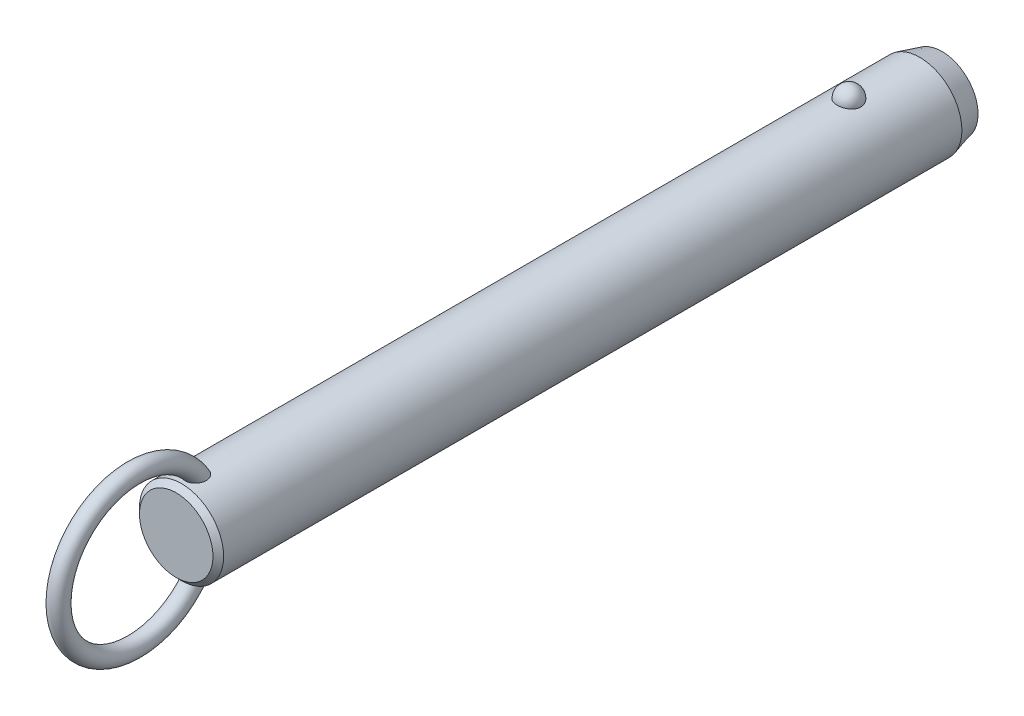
ISO-10303-21;
HEADER;
FILE_DESCRIPTION(('STEP AP214'),'2;1');
FILE_NAME('part.step','',(''),(''),'','','');
FILE_SCHEMA(('AUTOMOTIVE_DESIGN { 1 0 10303 214 1 1 1 1 }'));
ENDSEC;
DATA;
#1=APPLICATION_CONTEXT('core data for automotive mechanical design processes');
#2=APPLICATION_PROTOCOL_DEFINITION('international standard','automotive_design',2000,#1);
#3=PRODUCT_CONTEXT('',#1,'mechanical');
#4=PRODUCT('Part','Part','',(#3));
#5=PRODUCT_RELATED_PRODUCT_CATEGORY('part','',(#4));
#6=PRODUCT_DEFINITION_FORMATION('','',#4);
#7=PRODUCT_DEFINITION_CONTEXT('part definition',#1,'design');
#8=PRODUCT_DEFINITION('design','',#6,#7);
#9=PRODUCT_DEFINITION_SHAPE('','',#8);
#10=(LENGTH_UNIT() NAMED_UNIT(*) SI_UNIT(.MILLI.,.METRE.));
#11=(NAMED_UNIT(*) PLANE_ANGLE_UNIT() SI_UNIT($,.RADIAN.));
#12=(NAMED_UNIT(*) SI_UNIT($,.STERADIAN.) SOLID_ANGLE_UNIT());
#13=UNCERTAINTY_MEASURE_WITH_UNIT(LENGTH_MEASURE(1.E-05),#10,'distance_accuracy_value','');
#14=(GEOMETRIC_REPRESENTATION_CONTEXT(3) GLOBAL_UNCERTAINTY_ASSIGNED_CONTEXT((#13)) GLOBAL_UNIT_ASSIGNED_CONTEXT((#10,
#11,#12)) REPRESENTATION_CONTEXT('',''));
#15=CARTESIAN_POINT('',(0.,0.,0.));
#16=DIRECTION('',(0.,0.,1.));
#17=DIRECTION('',(1.,0.,0.));
#18=AXIS2_PLACEMENT_3D('',#15,#16,#17);
#19=CARTESIAN_POINT('',(0.,0.,139.7));
#20=DIRECTION('',(0.,0.,-1.));
#21=DIRECTION('',(-1.,0.,0.));
#22=AXIS2_PLACEMENT_3D('',#19,#20,#21);
#23=CYLINDRICAL_SURFACE('',#22,9.5);
#24=CARTESIAN_POINT('',(2.67259918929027,9.11631578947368,-2.70000000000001));
#25=CARTESIAN_POINT('',(2.6725968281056,9.11631786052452,-2.54909854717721));
#26=CARTESIAN_POINT('',(2.66030567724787,9.11994722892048,-2.39816735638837));
#27=CARTESIAN_POINT('',(2.6114347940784,9.13405924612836,-2.10058568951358));
#28=CARTESIAN_POINT('',(2.57484658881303,9.14454428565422,-1.95393672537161));
#29=CARTESIAN_POINT('',(2.47830875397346,9.17117631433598,-1.66916069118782));
#30=CARTESIAN_POINT('',(2.41836936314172,9.18732082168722,-1.53102991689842));
#31=CARTESIAN_POINT('',(2.27661331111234,9.22346780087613,-1.26705393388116));
#32=CARTESIAN_POINT('',(2.19479699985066,9.24347021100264,-1.14120852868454));
#33=CARTESIAN_POINT('',(2.01085282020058,9.28522401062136,-0.904632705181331));
#34=CARTESIAN_POINT('',(1.90862396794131,9.30698376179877,-0.793982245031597));
#35=CARTESIAN_POINT('',(1.6867437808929,9.34973971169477,-0.591607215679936));
#36=CARTESIAN_POINT('',(1.56709244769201,9.37073591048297,-0.499882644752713));
#37=CARTESIAN_POINT('',(1.31393976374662,9.40956370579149,-0.338167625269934));
#38=CARTESIAN_POINT('',(1.18048026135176,9.42740444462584,-0.268113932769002));
#39=CARTESIAN_POINT('',(0.903154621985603,9.45799906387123,-0.151390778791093));
#40=CARTESIAN_POINT('',(0.759289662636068,9.47075351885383,-0.104718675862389));
#41=CARTESIAN_POINT('',(0.468074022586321,9.48956256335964,-0.0367633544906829));
#42=CARTESIAN_POINT('',(0.320836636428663,9.49573643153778,-0.0150275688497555));
#43=CARTESIAN_POINT('',(0.0246714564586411,9.50112183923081,0.00396199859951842));
#44=CARTESIAN_POINT('',(-0.124256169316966,9.50033406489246,0.00121819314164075));
#45=CARTESIAN_POINT('',(-0.417264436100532,9.4919475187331,-0.0284441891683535));
#46=CARTESIAN_POINT('',(-0.56138413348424,9.48444885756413,-0.0550074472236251));
#47=CARTESIAN_POINT('',(-0.842986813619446,9.46357853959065,-0.131064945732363));
#48=CARTESIAN_POINT('',(-0.980469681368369,9.450206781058,-0.180559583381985));
#49=CARTESIAN_POINT('',(-1.24585005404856,9.41890822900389,-0.301476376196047));
#50=CARTESIAN_POINT('',(-1.37368611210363,9.40095498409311,-0.373026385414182));
#51=CARTESIAN_POINT('',(-1.61552738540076,9.36242964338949,-0.536025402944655));
#52=CARTESIAN_POINT('',(-1.72953116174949,9.34185727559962,-0.627476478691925));
#53=CARTESIAN_POINT('',(-1.9429225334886,9.29984568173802,-0.829844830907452));
#54=CARTESIAN_POINT('',(-2.04198021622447,9.27839736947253,-0.94110821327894));
#55=CARTESIAN_POINT('',(-2.22026460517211,9.23735994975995,-1.17883414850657));
#56=CARTESIAN_POINT('',(-2.29948985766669,9.21777097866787,-1.30529781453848));
#57=CARTESIAN_POINT('',(-2.43697287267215,9.18238994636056,-1.57158566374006));
#58=CARTESIAN_POINT('',(-2.49497068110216,9.16664569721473,-1.71155057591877));
#59=CARTESIAN_POINT('',(-2.5872073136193,9.14104303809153,-1.99961197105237));
#60=CARTESIAN_POINT('',(-2.62144683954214,9.13118445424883,-2.14770821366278));
#61=CARTESIAN_POINT('',(-2.66521466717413,9.11850622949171,-2.44715424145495));
#62=CARTESIAN_POINT('',(-2.67484831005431,9.11565658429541,-2.59848735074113));
#63=CARTESIAN_POINT('',(-2.66946735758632,9.11723375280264,-2.90067317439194));
#64=CARTESIAN_POINT('',(-2.65445345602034,9.12166036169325,-3.05152590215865));
#65=CARTESIAN_POINT('',(-2.60029711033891,9.13724422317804,-3.34766110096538));
#66=CARTESIAN_POINT('',(-2.56127978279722,9.14836656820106,-3.49296833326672));
#67=CARTESIAN_POINT('',(-2.46018844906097,9.17606676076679,-3.77477535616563));
#68=CARTESIAN_POINT('',(-2.39811349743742,9.1926448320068,-3.9112747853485));
#69=CARTESIAN_POINT('',(-2.25202303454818,9.22952198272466,-4.17244273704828));
#70=CARTESIAN_POINT('',(-2.16788714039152,9.24984129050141,-4.29704106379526));
#71=CARTESIAN_POINT('',(-1.9799408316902,9.29188255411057,-4.53013066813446));
#72=CARTESIAN_POINT('',(-1.87612963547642,9.31360456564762,-4.63862130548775));
#73=CARTESIAN_POINT('',(-1.65105429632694,9.35612959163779,-4.8369029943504));
#74=CARTESIAN_POINT('',(-1.52972405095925,9.37692871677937,-4.92661991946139));
#75=CARTESIAN_POINT('',(-1.27318250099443,9.41518970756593,-5.08429106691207));
#76=CARTESIAN_POINT('',(-1.13797219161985,9.432651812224,-5.15224684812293));
#77=CARTESIAN_POINT('',(-0.859280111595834,9.46208255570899,-5.26371827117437));
#78=CARTESIAN_POINT('',(-0.715925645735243,9.47411833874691,-5.30753421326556));
#79=CARTESIAN_POINT('',(-0.423550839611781,9.4916822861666,-5.37076321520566));
#80=CARTESIAN_POINT('',(-0.2745312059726,9.49721125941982,-5.39017930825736));
#81=CARTESIAN_POINT('',(0.0218446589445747,9.50110860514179,-5.40390587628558));
#82=CARTESIAN_POINT('',(0.16917707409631,9.49961381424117,-5.39869609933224));
#83=CARTESIAN_POINT('',(0.460808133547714,9.48993906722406,-5.36441955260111));
#84=CARTESIAN_POINT('',(0.605106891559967,9.48175936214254,-5.33535367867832));
#85=CARTESIAN_POINT('',(0.886027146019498,9.4596376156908,-5.25435587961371));
#86=CARTESIAN_POINT('',(1.02267710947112,9.44571881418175,-5.20251612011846));
#87=CARTESIAN_POINT('',(1.28523827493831,9.41358993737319,-5.07741549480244));
#88=CARTESIAN_POINT('',(1.41114877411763,9.39537958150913,-5.00415322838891));
#89=CARTESIAN_POINT('',(1.65085227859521,9.3562644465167,-4.83684599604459));
#90=CARTESIAN_POINT('',(1.76442346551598,9.33532178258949,-4.74249218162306));
#91=CARTESIAN_POINT('',(1.97425672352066,9.29321198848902,-4.53620389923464));
#92=CARTESIAN_POINT('',(2.07051582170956,9.27204482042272,-4.42426641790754));
#93=CARTESIAN_POINT('',(2.24490086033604,9.23139221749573,-4.18363183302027));
#94=CARTESIAN_POINT('',(2.32267019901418,9.21194380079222,-4.05466990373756));
#95=CARTESIAN_POINT('',(2.45584092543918,9.1773419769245,-3.78517836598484));
#96=CARTESIAN_POINT('',(2.5112497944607,9.16218713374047,-3.64465264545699));
#97=CARTESIAN_POINT('',(2.59380876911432,9.13913522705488,-3.37104301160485));
#98=CARTESIAN_POINT('',(2.62330266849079,9.13064624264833,-3.23871053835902));
#99=CARTESIAN_POINT('',(2.66269870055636,9.11923566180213,-2.97092664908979));
#100=CARTESIAN_POINT('',(2.67260130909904,9.11631393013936,-2.83547530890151));
#101=CARTESIAN_POINT('',(2.67259918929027,9.11631578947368,-2.70000000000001));
#102=B_SPLINE_CURVE_WITH_KNOTS('',3,(#24,#25,#26,#27,#28,#29,#30,#31,#32,#33,#34,#35,#36,#37,
#38,#39,#40,#41,#42,#43,#44,#45,#46,#47,#48,#49,#50,#51,#52,#53,#54,#55,#56,#57,#58,#59,#60,#61,
#62,#63,#64,#65,#66,#67,#68,#69,#70,#71,#72,#73,#74,#75,#76,#77,#78,#79,#80,#81,#82,#83,#84,#85,
#86,#87,#88,#89,#90,#91,#92,#93,#94,#95,#96,#97,#98,#99,#100,#101),.UNSPECIFIED.,.T.,.F.,(4,2,2,
2,2,2,2,2,2,2,2,2,2,2,2,2,2,2,2,2,2,2,2,2,2,2,2,2,2,2,2,2,2,2,2,2,2,2,4),(0.,0.452217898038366,
0.904593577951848,1.35677112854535,1.80894144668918,2.26340676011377,2.71787203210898,
3.17099820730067,3.62407318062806,4.0687883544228,4.51345969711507,4.95160616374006,
5.38976021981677,5.83050358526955,6.27129275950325,6.72071308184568,7.17016633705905,
7.62495278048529,8.07972578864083,8.53254856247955,8.98535859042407,9.43582813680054,
9.88631615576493,10.3393155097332,10.7923328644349,11.2471065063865,11.7018475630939,
12.150795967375,12.599688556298,13.0398725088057,13.4800399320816,13.9184421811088,
14.3568730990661,14.802202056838,15.2476074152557,15.7010097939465,16.1542603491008,
16.5602594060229,16.966248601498),.UNSPECIFIED.);
#103=CARTESIAN_POINT('',(2.67259918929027,9.11631578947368,-2.70000000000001));
#104=VERTEX_POINT('',#103);
#105=EDGE_CURVE('E41',#104,#104,#102,.T.);
#106=ORIENTED_EDGE('',*,*,#105,.T.);
#107=EDGE_LOOP('',(#106));
#108=FACE_BOUND('',#107,.T.);
#109=CARTESIAN_POINT('',(0.,0.,148.02));
#110=DIRECTION('',(0.,0.,1.));
#111=DIRECTION('',(1.,0.,0.));
#112=AXIS2_PLACEMENT_3D('',#109,#110,#111);
#113=CIRCLE('',#112,9.5);
#114=CARTESIAN_POINT('',(9.5,0.,148.02));
#115=VERTEX_POINT('',#114);
#116=EDGE_CURVE('E10',#115,#115,#113,.F.);
#117=ORIENTED_EDGE('',*,*,#116,.T.);
#118=EDGE_LOOP('',(#117));
#119=FACE_BOUND('',#118,.T.);
#120=CARTESIAN_POINT('',(-0.697062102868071,-9.47439269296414,142.367808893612));
#121=CARTESIAN_POINT('',(-0.799579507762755,-9.46685146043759,142.407482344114));
#122=CARTESIAN_POINT('',(-0.898575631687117,-9.45788043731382,142.4559309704));
#123=CARTESIAN_POINT('',(-1.08670047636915,-9.43811593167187,142.568868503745));
#124=CARTESIAN_POINT('',(-1.17583204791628,-9.42732297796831,142.633352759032));
#125=CARTESIAN_POINT('',(-1.34179806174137,-9.40513672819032,142.776209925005));
#126=CARTESIAN_POINT('',(-1.41865133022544,-9.39374438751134,142.854561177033));
#127=CARTESIAN_POINT('',(-1.55860047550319,-9.37154196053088,143.022752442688));
#128=CARTESIAN_POINT('',(-1.62169476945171,-9.3607319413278,143.11259377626));
#129=CARTESIAN_POINT('',(-1.73527695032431,-9.34035749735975,143.304500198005));
#130=CARTESIAN_POINT('',(-1.78522266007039,-9.33085270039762,143.406891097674));
#131=CARTESIAN_POINT('',(-1.86924997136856,-9.3143834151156,143.618148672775));
#132=CARTESIAN_POINT('',(-1.90332570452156,-9.30741986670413,143.727017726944));
#133=CARTESIAN_POINT('',(-1.95893603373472,-9.29588482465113,143.960473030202));
#134=CARTESIAN_POINT('',(-1.97872420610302,-9.29165182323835,144.085489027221));
#135=CARTESIAN_POINT('',(-2.00062129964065,-9.28695978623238,144.337080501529));
#136=CARTESIAN_POINT('',(-2.00272284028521,-9.28650232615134,144.463656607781));
#137=CARTESIAN_POINT('',(-1.98958876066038,-9.28932750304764,144.736815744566));
#138=CARTESIAN_POINT('',(-1.97143366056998,-9.2932400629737,144.883251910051));
#139=CARTESIAN_POINT('',(-1.91479925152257,-9.30507151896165,145.172062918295));
#140=CARTESIAN_POINT('',(-1.87629122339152,-9.31299607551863,145.314431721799));
#141=CARTESIAN_POINT('',(-1.77225683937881,-9.33340232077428,145.615172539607));
#142=CARTESIAN_POINT('',(-1.70334898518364,-9.34641636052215,145.772369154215));
#143=CARTESIAN_POINT('',(-1.58111062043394,-9.36759153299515,145.997517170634));
#144=CARTESIAN_POINT('',(-1.53721459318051,-9.37492619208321,146.070796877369));
#145=CARTESIAN_POINT('',(-1.4430263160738,-9.38988566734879,146.21307405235));
#146=CARTESIAN_POINT('',(-1.39273721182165,-9.39751033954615,146.282073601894));
#147=CARTESIAN_POINT('',(-1.26775962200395,-9.41530678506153,146.436983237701));
#148=CARTESIAN_POINT('',(-1.19052326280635,-9.42548108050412,146.520871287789));
#149=CARTESIAN_POINT('',(-1.02420241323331,-9.44499825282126,146.676008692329));
#150=CARTESIAN_POINT('',(-0.93513986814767,-9.45434261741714,146.747280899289));
#151=CARTESIAN_POINT('',(-0.766610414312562,-9.46930670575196,146.858695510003));
#152=CARTESIAN_POINT('',(-0.689439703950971,-9.47529223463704,146.902235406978));
#153=CARTESIAN_POINT('',(-0.528942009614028,-9.48560294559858,146.97631336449));
#154=CARTESIAN_POINT('',(-0.445620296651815,-9.48992953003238,147.006862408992));
#155=CARTESIAN_POINT('',(-0.273901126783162,-9.49644161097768,147.052579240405));
#156=CARTESIAN_POINT('',(-0.18546574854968,-9.49860811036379,147.06761059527));
#157=CARTESIAN_POINT('',(-0.00734541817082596,-9.5004135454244,147.080149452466));
#158=CARTESIAN_POINT('',(0.0823387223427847,-9.50005405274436,147.077667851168));
#159=CARTESIAN_POINT('',(0.247679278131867,-9.49708301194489,147.056995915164));
#160=CARTESIAN_POINT('',(0.323620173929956,-9.49477609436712,147.040930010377));
#161=CARTESIAN_POINT('',(0.471981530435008,-9.48855917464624,146.997172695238));
#162=CARTESIAN_POINT('',(0.544400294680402,-9.48464840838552,146.969475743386));
#163=CARTESIAN_POINT('',(0.708947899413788,-9.47398336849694,146.89280266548));
#164=CARTESIAN_POINT('',(0.799149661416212,-9.46671310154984,146.839774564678));
#165=CARTESIAN_POINT('',(0.969783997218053,-9.45076225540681,146.719973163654));
#166=CARTESIAN_POINT('',(1.050194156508,-9.44207854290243,146.653169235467));
#167=CARTESIAN_POINT('',(1.23092343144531,-9.42051459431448,146.480759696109));
#168=CARTESIAN_POINT('',(1.32652499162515,-9.40733378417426,146.37026193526));
#169=CARTESIAN_POINT('',(1.49893121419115,-9.38140745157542,146.135561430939));
#170=CARTESIAN_POINT('',(1.5757161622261,-9.36866239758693,146.011344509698));
#171=CARTESIAN_POINT('',(1.71285426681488,-9.34457644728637,145.749389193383));
#172=CARTESIAN_POINT('',(1.77266365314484,-9.33328726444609,145.61136233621));
#173=CARTESIAN_POINT('',(1.87239208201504,-9.31379209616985,145.328051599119));
#174=CARTESIAN_POINT('',(1.91230158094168,-9.3055875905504,145.182764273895));
#175=CARTESIAN_POINT('',(1.97604189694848,-9.29228394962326,144.862028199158));
#176=CARTESIAN_POINT('',(1.9958743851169,-9.28797202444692,144.685724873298));
#177=CARTESIAN_POINT('',(2.0029570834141,-9.28645519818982,144.332414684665));
#178=CARTESIAN_POINT('',(1.99025930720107,-9.28923895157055,144.155409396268));
#179=CARTESIAN_POINT('',(1.93735479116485,-9.30038134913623,143.856338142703));
#180=CARTESIAN_POINT('',(1.90576827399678,-9.30697680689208,143.732667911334));
#181=CARTESIAN_POINT('',(1.8228748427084,-9.32356855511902,143.492329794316));
#182=CARTESIAN_POINT('',(1.77158213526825,-9.33356239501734,143.375656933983));
#183=CARTESIAN_POINT('',(1.64885744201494,-9.35602275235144,143.152706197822));
#184=CARTESIAN_POINT('',(1.57730995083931,-9.36850332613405,143.046492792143));
#185=CARTESIAN_POINT('',(1.41543264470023,-9.39431873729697,142.849553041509));
#186=CARTESIAN_POINT('',(1.32510883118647,-9.40765330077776,142.758821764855));
#187=CARTESIAN_POINT('',(1.13846223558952,-9.43195720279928,142.605033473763));
#188=CARTESIAN_POINT('',(1.04369890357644,-9.44302894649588,142.540094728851));
#189=CARTESIAN_POINT('',(0.843965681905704,-9.46296805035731,142.428038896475));
#190=CARTESIAN_POINT('',(0.739000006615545,-9.47183631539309,142.380914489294));
#191=CARTESIAN_POINT('',(0.528175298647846,-9.48586140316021,142.308117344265));
#192=CARTESIAN_POINT('',(0.422686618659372,-9.49119633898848,142.28140249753));
#193=CARTESIAN_POINT('',(0.208590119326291,-9.49831365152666,142.246013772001));
#194=CARTESIAN_POINT('',(0.0999817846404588,-9.500095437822,142.237342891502));
#195=CARTESIAN_POINT('',(-0.126104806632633,-9.49988861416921,142.238350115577));
#196=CARTESIAN_POINT('',(-0.243578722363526,-9.49757821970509,142.249594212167));
#197=CARTESIAN_POINT('',(-0.474390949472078,-9.48885165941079,142.293167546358));
#198=CARTESIAN_POINT('',(-0.587729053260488,-9.48243528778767,142.325497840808));
#199=CARTESIAN_POINT('',(-0.697062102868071,-9.47439269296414,142.367808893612));
#200=B_SPLINE_CURVE_WITH_KNOTS('',3,(#120,#121,#122,#123,#124,#125,#126,#127,#128,#129,#130,
#131,#132,#133,#134,#135,#136,#137,#138,#139,#140,#141,#142,#143,#144,#145,#146,#147,#148,#149,
#150,#151,#152,#153,#154,#155,#156,#157,#158,#159,#160,#161,#162,#163,#164,#165,#166,#167,#168,
#169,#170,#171,#172,#173,#174,#175,#176,#177,#178,#179,#180,#181,#182,#183,#184,#185,#186,#187,
#188,#189,#190,#191,#192,#193,#194,#195,#196,#197,#198,#199),.UNSPECIFIED.,.T.,.F.,(4,2,2,2,2,2,
2,2,2,2,2,2,2,2,2,2,2,2,2,2,2,2,2,2,2,2,2,2,2,2,2,2,2,2,2,2,2,2,2,4),(0.,0.330119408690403,
0.660143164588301,0.989655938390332,1.31920659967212,1.66074728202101,2.00241415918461,
2.38088696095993,2.75951768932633,3.20065679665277,3.64242004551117,4.15620996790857,
4.4131416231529,4.66994734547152,5.01228664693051,5.35399933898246,5.61943037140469,
5.88463652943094,6.15215502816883,6.4195070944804,6.65144391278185,6.88349136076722,
7.19641200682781,7.51003602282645,7.94779711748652,8.3860149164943,8.83699707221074,
9.28819530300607,9.81778662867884,10.34653170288,10.7284172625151,11.1100280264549,
11.4938603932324,11.8775702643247,12.2220189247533,12.5663259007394,12.8915939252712,
13.2169159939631,13.5689650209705,13.9210316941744),.UNSPECIFIED.);
#201=CARTESIAN_POINT('',(-0.697062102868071,-9.47439269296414,142.367808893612));
#202=VERTEX_POINT('',#201);
#203=EDGE_CURVE('E59',#202,#202,#200,.T.);
#204=ORIENTED_EDGE('',*,*,#203,.T.);
#205=EDGE_LOOP('',(#204));
#206=FACE_BOUND('',#205,.T.);
#207=CARTESIAN_POINT('',(-0.697062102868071,9.47439269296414,142.367808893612));
#208=CARTESIAN_POINT('',(-0.597792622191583,9.48169483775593,142.329395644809));
#209=CARTESIAN_POINT('',(-0.495106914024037,9.48766580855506,142.299168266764));
#210=CARTESIAN_POINT('',(-0.285876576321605,9.49627648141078,142.256032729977));
#211=CARTESIAN_POINT('',(-0.179324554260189,9.49890941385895,142.243159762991));
#212=CARTESIAN_POINT('',(0.0344157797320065,9.50053798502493,142.235166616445));
#213=CARTESIAN_POINT('',(0.141603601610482,9.49953613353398,142.240034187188));
#214=CARTESIAN_POINT('',(0.35356357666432,9.49401038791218,142.267365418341));
#215=CARTESIAN_POINT('',(0.458336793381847,9.48948807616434,142.28982117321));
#216=CARTESIAN_POINT('',(0.662493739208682,9.4774236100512,142.351671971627));
#217=CARTESIAN_POINT('',(0.761881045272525,9.46988348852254,142.391055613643));
#218=CARTESIAN_POINT('',(0.952608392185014,9.45260382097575,142.485634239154));
#219=CARTESIAN_POINT('',(1.04394806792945,9.44286417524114,142.540829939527));
#220=CARTESIAN_POINT('',(1.21712767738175,9.42211760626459,142.666066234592));
#221=CARTESIAN_POINT('',(1.29885671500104,9.41109835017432,142.736257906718));
#222=CARTESIAN_POINT('',(1.44978975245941,9.38903310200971,142.888980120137));
#223=CARTESIAN_POINT('',(1.51899278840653,9.37798710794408,142.971511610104));
#224=CARTESIAN_POINT('',(1.64602857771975,9.35654375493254,143.149776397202));
#225=CARTESIAN_POINT('',(1.70333052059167,9.34618688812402,143.245891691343));
#226=CARTESIAN_POINT('',(1.80259341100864,9.32755128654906,143.445897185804));
#227=CARTESIAN_POINT('',(1.84454942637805,9.31927322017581,143.549789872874));
#228=CARTESIAN_POINT('',(1.91637039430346,9.30478365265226,143.772213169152));
#229=CARTESIAN_POINT('',(1.944805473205,9.29882552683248,143.891219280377));
#230=CARTESIAN_POINT('',(1.98449865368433,9.29043398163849,144.132143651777));
#231=CARTESIAN_POINT('',(1.99574908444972,9.28800213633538,144.254063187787));
#232=CARTESIAN_POINT('',(2.00275141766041,9.28649645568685,144.516932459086));
#233=CARTESIAN_POINT('',(1.99588238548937,9.28799035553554,144.657952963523));
#234=CARTESIAN_POINT('',(1.96270559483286,9.29505517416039,144.937621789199));
#235=CARTESIAN_POINT('',(1.93637872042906,9.30063010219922,145.076267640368));
#236=CARTESIAN_POINT('',(1.85949176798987,9.31633564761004,145.372561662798));
#237=CARTESIAN_POINT('',(1.80549792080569,9.3270926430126,145.529290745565));
#238=CARTESIAN_POINT('',(1.67376869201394,9.3516306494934,145.832284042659));
#239=CARTESIAN_POINT('',(1.59603181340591,9.36541185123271,145.978547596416));
#240=CARTESIAN_POINT('',(1.4360277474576,9.39110706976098,146.225813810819));
#241=CARTESIAN_POINT('',(1.35831795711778,9.40278656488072,146.329791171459));
#242=CARTESIAN_POINT('',(1.18774483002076,9.42585025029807,146.524534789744));
#243=CARTESIAN_POINT('',(1.09490932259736,9.43723493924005,146.615324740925));
#244=CARTESIAN_POINT('',(0.921110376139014,9.45552616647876,146.75620334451));
#245=CARTESIAN_POINT('',(0.843738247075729,9.46281058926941,146.810656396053));
#246=CARTESIAN_POINT('',(0.681245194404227,9.47589120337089,146.906711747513));
#247=CARTESIAN_POINT('',(0.596135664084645,9.48168953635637,146.948332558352));
#248=CARTESIAN_POINT('',(0.433779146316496,9.49038144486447,147.010089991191));
#249=CARTESIAN_POINT('',(0.357459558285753,9.49359170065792,147.03260136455));
#250=CARTESIAN_POINT('',(0.202074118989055,9.49816761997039,147.064574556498));
#251=CARTESIAN_POINT('',(0.123010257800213,9.49953459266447,147.074045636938));
#252=CARTESIAN_POINT('',(-0.0357372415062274,9.50026497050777,147.079114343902));
#253=CARTESIAN_POINT('',(-0.115421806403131,9.49962433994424,147.074684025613));
#254=CARTESIAN_POINT('',(-0.272823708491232,9.49640854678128,147.052296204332));
#255=CARTESIAN_POINT('',(-0.350540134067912,9.4938325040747,147.034332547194));
#256=CARTESIAN_POINT('',(-0.500580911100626,9.48709462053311,146.986802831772));
#257=CARTESIAN_POINT('',(-0.572979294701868,9.48296359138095,146.957461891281));
#258=CARTESIAN_POINT('',(-0.712864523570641,9.47347609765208,146.889008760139));
#259=CARTESIAN_POINT('',(-0.780349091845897,9.46811906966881,146.849892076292));
#260=CARTESIAN_POINT('',(-0.946309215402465,9.45329720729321,146.739432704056));
#261=CARTESIAN_POINT('',(-1.04090230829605,9.44321512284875,146.662329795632));
#262=CARTESIAN_POINT('',(-1.21661929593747,9.42219227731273,146.49409718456));
#263=CARTESIAN_POINT('',(-1.29770519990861,9.41124921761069,146.402929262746));
#264=CARTESIAN_POINT('',(-1.47319646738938,9.38563439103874,146.176162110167));
#265=CARTESIAN_POINT('',(-1.56208878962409,9.37102009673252,146.036289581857));
#266=CARTESIAN_POINT('',(-1.71623987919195,9.34401559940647,145.743950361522));
#267=CARTESIAN_POINT('',(-1.78147866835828,9.33162728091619,145.591473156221));
#268=CARTESIAN_POINT('',(-1.88853837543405,9.31055541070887,145.275647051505));
#269=CARTESIAN_POINT('',(-1.92998995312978,9.30193076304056,145.112168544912));
#270=CARTESIAN_POINT('',(-1.98590726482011,9.29015757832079,144.780526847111));
#271=CARTESIAN_POINT('',(-2.0004070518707,9.2870021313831,144.612369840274));
#272=CARTESIAN_POINT('',(-1.99964701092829,9.28716218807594,144.305080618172));
#273=CARTESIAN_POINT('',(-1.98908145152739,9.28945704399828,144.165936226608));
#274=CARTESIAN_POINT('',(-1.94566294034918,9.29865169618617,143.891153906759));
#275=CARTESIAN_POINT('',(-1.9128206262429,9.30554929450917,143.755514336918));
#276=CARTESIAN_POINT('',(-1.84582133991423,9.31898248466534,143.557802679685));
#277=CARTESIAN_POINT('',(-1.82038084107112,9.32400364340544,143.492583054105));
#278=CARTESIAN_POINT('',(-1.76350511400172,9.33492884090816,143.364903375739));
#279=CARTESIAN_POINT('',(-1.73207305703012,9.34083241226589,143.302441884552));
#280=CARTESIAN_POINT('',(-1.66324243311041,9.35333332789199,143.18094078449));
#281=CARTESIAN_POINT('',(-1.62584239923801,9.35993084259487,143.121902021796));
#282=CARTESIAN_POINT('',(-1.54527678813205,9.37356864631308,143.007987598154));
#283=CARTESIAN_POINT('',(-1.50211241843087,9.38060884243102,142.953111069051));
#284=CARTESIAN_POINT('',(-1.3768114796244,9.40004442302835,142.809961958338));
#285=CARTESIAN_POINT('',(-1.28916358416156,9.41261047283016,142.726429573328));
#286=CARTESIAN_POINT('',(-1.09996826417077,9.43658180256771,142.577236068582));
#287=CARTESIAN_POINT('',(-0.998461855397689,9.44799034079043,142.511523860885));
#288=CARTESIAN_POINT('',(-0.860188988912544,9.46103017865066,142.4394367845));
#289=CARTESIAN_POINT('',(-0.828141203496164,9.46389141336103,142.423851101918));
#290=CARTESIAN_POINT('',(-0.763210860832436,9.46934915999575,142.394473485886));
#291=CARTESIAN_POINT('',(-0.730328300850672,9.47194567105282,142.380681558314));
#292=CARTESIAN_POINT('',(-0.697062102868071,9.47439269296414,142.367808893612));
#293=B_SPLINE_CURVE_WITH_KNOTS('',3,(#207,#208,#209,#210,#211,#212,#213,#214,#215,#216,#217,
#218,#219,#220,#221,#222,#223,#224,#225,#226,#227,#228,#229,#230,#231,#232,#233,#234,#235,#236,
#237,#238,#239,#240,#241,#242,#243,#244,#245,#246,#247,#248,#249,#250,#251,#252,#253,#254,#255,
#256,#257,#258,#259,#260,#261,#262,#263,#264,#265,#266,#267,#268,#269,#270,#271,#272,#273,#274,
#275,#276,#277,#278,#279,#280,#281,#282,#283,#284,#285,#286,#287,#288,#289,#290,#291,#292),
.UNSPECIFIED.,.T.,.F.,(4,2,2,2,2,2,2,2,2,2,2,2,2,2,2,2,2,2,2,2,2,2,2,2,2,2,2,2,2,2,2,2,2,2,2,2,
2,2,2,2,2,2,4),(0.,0.319942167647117,0.640532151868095,0.96090081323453,1.2811255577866,
1.60113495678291,1.92115886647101,2.24457323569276,2.56801248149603,2.90371927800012,
3.23953387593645,3.60560313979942,3.97183576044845,4.39383693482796,4.8162532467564,
5.31257045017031,5.80891895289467,6.19868344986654,6.58773876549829,6.87145417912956,
7.15475838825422,7.39263751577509,7.63034760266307,7.86853584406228,8.10683246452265,
8.3406366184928,8.57454843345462,8.93983939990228,9.30614105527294,9.80266668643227,
10.2996107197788,10.8040753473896,11.3079021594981,11.7249776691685,12.1418541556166,
12.3521485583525,12.5623319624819,12.7725671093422,12.9827582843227,13.345827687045,
13.7078449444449,13.8150604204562,13.9222762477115),.UNSPECIFIED.);
#294=CARTESIAN_POINT('',(-0.697062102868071,9.47439269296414,142.367808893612));
#295=VERTEX_POINT('',#294);
#296=EDGE_CURVE('E67',#295,#295,#293,.T.);
#297=ORIENTED_EDGE('',*,*,#296,.T.);
#298=EDGE_LOOP('',(#297));
#299=FACE_BOUND('',#298,.T.);
#300=CARTESIAN_POINT('',(0.,0.,-18.6999999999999));
#301=DIRECTION('',(0.,0.,-1.));
#302=DIRECTION('',(-1.,0.,0.));
#303=AXIS2_PLACEMENT_3D('',#300,#301,#302);
#304=CIRCLE('',#303,9.5);
#305=CARTESIAN_POINT('',(-9.5,0.,-18.6999999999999));
#306=VERTEX_POINT('',#305);
#307=EDGE_CURVE('E56',#306,#306,#304,.F.);
#308=ORIENTED_EDGE('',*,*,#307,.T.);
#309=EDGE_LOOP('',(#308));
#310=FACE_BOUND('',#309,.T.);
#311=ADVANCED_FACE('F37',(#108,#119,#206,#299,#310),#23,.T.);
#312=CARTESIAN_POINT('',(0.,0.,-23.7));
#313=DIRECTION('',(0.,0.,-1.));
#314=DIRECTION('',(-1.,0.,0.));
#315=AXIS2_PLACEMENT_3D('',#312,#313,#314);
#316=PLANE('',#315);
#317=CARTESIAN_POINT('',(0.,0.,-23.7));
#318=DIRECTION('',(0.,0.,-1.));
#319=DIRECTION('',(-1.,0.,0.));
#320=AXIS2_PLACEMENT_3D('',#317,#318,#319);
#321=CIRCLE('',#320,8.16025403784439);
#322=CARTESIAN_POINT('',(-8.16025403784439,0.,-23.7));
#323=VERTEX_POINT('',#322);
#324=EDGE_CURVE('E66',#323,#323,#321,.T.);
#325=ORIENTED_EDGE('',*,*,#324,.T.);
#326=EDGE_LOOP('',(#325));
#327=FACE_BOUND('',#326,.T.);
#328=ADVANCED_FACE('F85',(#327),#316,.T.);
#329=CARTESIAN_POINT('',(0.,0.,-23.7));
#330=DIRECTION('',(0.,0.,1.));
#331=DIRECTION('',(1.,0.,0.));
#332=AXIS2_PLACEMENT_3D('',#329,#330,#331);
#333=CONICAL_SURFACE('',#332,8.16025403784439,0.261799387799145);
#334=ORIENTED_EDGE('',*,*,#307,.F.);
#335=EDGE_LOOP('',(#334));
#336=FACE_BOUND('',#335,.T.);
#337=ORIENTED_EDGE('',*,*,#324,.F.);
#338=EDGE_LOOP('',(#337));
#339=FACE_BOUND('',#338,.T.);
#340=ADVANCED_FACE('F83',(#336,#339),#333,.T.);
#341=CARTESIAN_POINT('',(0.,0.,149.22));
#342=DIRECTION('',(0.,0.,1.));
#343=DIRECTION('',(1.,0.,0.));
#344=AXIS2_PLACEMENT_3D('',#341,#342,#343);
#345=PLANE('',#344);
#346=CARTESIAN_POINT('',(0.,0.,149.22));
#347=DIRECTION('',(0.,0.,1.));
#348=DIRECTION('',(1.,0.,0.));
#349=AXIS2_PLACEMENT_3D('',#346,#347,#348);
#350=CIRCLE('',#349,8.30000000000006);
#351=CARTESIAN_POINT('',(8.30000000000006,0.,149.22));
#352=VERTEX_POINT('',#351);
#353=EDGE_CURVE('E50',#352,#352,#350,.T.);
#354=ORIENTED_EDGE('',*,*,#353,.T.);
#355=EDGE_LOOP('',(#354));
#356=FACE_BOUND('',#355,.T.);
#357=ADVANCED_FACE('F77',(#356),#345,.T.);
#358=CARTESIAN_POINT('',(0.,0.,158.75));
#359=DIRECTION('',(1.,0.,0.));
#360=DIRECTION('',(0.,0.,-1.));
#361=AXIS2_PLACEMENT_3D('',#358,#359,#360);
#362=TOROIDAL_SURFACE('',#361,17.05,2.);
#363=ORIENTED_EDGE('',*,*,#296,.F.);
#364=EDGE_LOOP('',(#363));
#365=FACE_BOUND('',#364,.T.);
#366=ORIENTED_EDGE('',*,*,#203,.F.);
#367=EDGE_LOOP('',(#366));
#368=FACE_BOUND('',#367,.T.);
#369=ADVANCED_FACE('F73',(#365,#368),#362,.T.);
#370=CARTESIAN_POINT('',(0.,0.,149.22));
#371=DIRECTION('',(0.,0.,-1.));
#372=DIRECTION('',(-1.,0.,0.));
#373=AXIS2_PLACEMENT_3D('',#370,#371,#372);
#374=CONICAL_SURFACE('',#373,8.30000000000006,0.785398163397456);
#375=ORIENTED_EDGE('',*,*,#116,.F.);
#376=EDGE_LOOP('',(#375));
#377=FACE_BOUND('',#376,.T.);
#378=ORIENTED_EDGE('',*,*,#353,.F.);
#379=EDGE_LOOP('',(#378));
#380=FACE_BOUND('',#379,.T.);
#381=ADVANCED_FACE('F39',(#377,#380),#374,.T.);
#382=CARTESIAN_POINT('',(0.,9.5,-2.70000000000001));
#383=DIRECTION('',(0.,1.,0.));
#384=DIRECTION('',(0.,0.,-1.));
#385=AXIS2_PLACEMENT_3D('',#382,#383,#384);
#386=SPHERICAL_SURFACE('',#385,2.7);
#387=ORIENTED_EDGE('',*,*,#105,.F.);
#388=EDGE_LOOP('',(#387));
#389=FACE_BOUND('',#388,.T.);
#390=ADVANCED_FACE('F79',(#389),#386,.T.);
#391=CLOSED_SHELL('',(#311,#328,#340,#357,#369,#381,#390));
#392=MANIFOLD_SOLID_BREP('B2',#391);
#393=ADVANCED_BREP_SHAPE_REPRESENTATION('',(#18,#392),#14);
#394=SHAPE_DEFINITION_REPRESENTATION(#9,#393);
ENDSEC;
END-ISO-10303-21;
